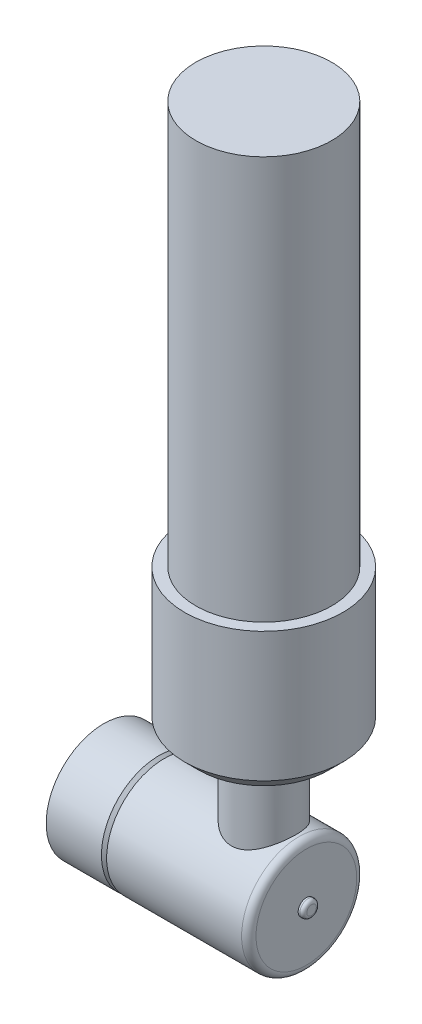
ISO-10303-21;
HEADER;
FILE_DESCRIPTION(('STEP AP214'),'2;1');
FILE_NAME('part.step','',(''),(''),'','','');
FILE_SCHEMA(('AUTOMOTIVE_DESIGN { 1 0 10303 214 1 1 1 1 }'));
ENDSEC;
DATA;
#1=APPLICATION_CONTEXT('core data for automotive mechanical design processes');
#2=APPLICATION_PROTOCOL_DEFINITION('international standard','automotive_design',2000,#1);
#3=PRODUCT_CONTEXT('',#1,'mechanical');
#4=PRODUCT('Part','Part','',(#3));
#5=PRODUCT_RELATED_PRODUCT_CATEGORY('part','',(#4));
#6=PRODUCT_DEFINITION_FORMATION('','',#4);
#7=PRODUCT_DEFINITION_CONTEXT('part definition',#1,'design');
#8=PRODUCT_DEFINITION('design','',#6,#7);
#9=PRODUCT_DEFINITION_SHAPE('','',#8);
#10=(LENGTH_UNIT() NAMED_UNIT(*) SI_UNIT(.MILLI.,.METRE.));
#11=(NAMED_UNIT(*) PLANE_ANGLE_UNIT() SI_UNIT($,.RADIAN.));
#12=(NAMED_UNIT(*) SI_UNIT($,.STERADIAN.) SOLID_ANGLE_UNIT());
#13=UNCERTAINTY_MEASURE_WITH_UNIT(LENGTH_MEASURE(1.E-05),#10,'distance_accuracy_value','');
#14=(GEOMETRIC_REPRESENTATION_CONTEXT(3) GLOBAL_UNCERTAINTY_ASSIGNED_CONTEXT((#13)) GLOBAL_UNIT_ASSIGNED_CONTEXT((#10,
#11,#12)) REPRESENTATION_CONTEXT('',''));
#15=CARTESIAN_POINT('',(0.,0.,0.));
#16=DIRECTION('',(0.,0.,1.));
#17=DIRECTION('',(1.,0.,0.));
#18=AXIS2_PLACEMENT_3D('',#15,#16,#17);
#19=CARTESIAN_POINT('',(91.694,0.,0.));
#20=DIRECTION('',(-1.,0.,0.));
#21=DIRECTION('',(0.,0.,1.));
#22=AXIS2_PLACEMENT_3D('',#19,#20,#21);
#23=CYLINDRICAL_SURFACE('',#22,3.6195);
#24=CARTESIAN_POINT('',(90.17,0.,0.));
#25=DIRECTION('',(1.,0.,0.));
#26=DIRECTION('',(0.,0.,-1.));
#27=AXIS2_PLACEMENT_3D('',#24,#25,#26);
#28=CIRCLE('',#27,3.6195);
#29=CARTESIAN_POINT('',(90.17,0.,-3.6195));
#30=VERTEX_POINT('',#29);
#31=EDGE_CURVE('E11',#30,#30,#28,.F.);
#32=ORIENTED_EDGE('',*,*,#31,.T.);
#33=EDGE_LOOP('',(#32));
#34=FACE_BOUND('',#33,.T.);
#35=CARTESIAN_POINT('',(89.408,0.,0.));
#36=DIRECTION('',(1.,0.,0.));
#37=DIRECTION('',(0.,0.,-1.));
#38=AXIS2_PLACEMENT_3D('',#35,#36,#37);
#39=CIRCLE('',#38,3.6195);
#40=CARTESIAN_POINT('',(89.408,0.,-3.6195));
#41=VERTEX_POINT('',#40);
#42=EDGE_CURVE('E400',#41,#41,#39,.T.);
#43=ORIENTED_EDGE('',*,*,#42,.T.);
#44=EDGE_LOOP('',(#43));
#45=FACE_BOUND('',#44,.T.);
#46=ADVANCED_FACE('F390',(#34,#45),#23,.T.);
#47=CARTESIAN_POINT('',(91.694,0.,0.));
#48=DIRECTION('',(1.,0.,0.));
#49=DIRECTION('',(0.,0.,-1.));
#50=AXIS2_PLACEMENT_3D('',#47,#48,#49);
#51=PLANE('',#50);
#52=CARTESIAN_POINT('',(91.694,0.,0.));
#53=DIRECTION('',(1.,0.,0.));
#54=DIRECTION('',(0.,0.,-1.));
#55=AXIS2_PLACEMENT_3D('',#52,#53,#54);
#56=CIRCLE('',#55,2.0955);
#57=CARTESIAN_POINT('',(91.694,0.,-2.0955));
#58=VERTEX_POINT('',#57);
#59=EDGE_CURVE('E396',#58,#58,#56,.T.);
#60=ORIENTED_EDGE('',*,*,#59,.T.);
#61=EDGE_LOOP('',(#60));
#62=FACE_BOUND('',#61,.T.);
#63=ADVANCED_FACE('F411',(#62),#51,.T.);
#64=CARTESIAN_POINT('',(89.408,0.,0.));
#65=DIRECTION('',(1.,0.,0.));
#66=DIRECTION('',(0.,0.,-1.));
#67=AXIS2_PLACEMENT_3D('',#64,#65,#66);
#68=PLANE('',#67);
#69=ORIENTED_EDGE('',*,*,#42,.F.);
#70=EDGE_LOOP('',(#69));
#71=FACE_BOUND('',#70,.T.);
#72=ADVANCED_FACE('F408',(#71),#68,.F.);
#73=CARTESIAN_POINT('',(90.17,0.,0.));
#74=DIRECTION('',(1.,0.,0.));
#75=DIRECTION('',(0.,0.,-1.));
#76=AXIS2_PLACEMENT_3D('',#73,#74,#75);
#77=TOROIDAL_SURFACE('',#76,2.0955,1.524);
#78=ORIENTED_EDGE('',*,*,#31,.F.);
#79=EDGE_LOOP('',(#78));
#80=FACE_BOUND('',#79,.T.);
#81=ORIENTED_EDGE('',*,*,#59,.F.);
#82=EDGE_LOOP('',(#81));
#83=FACE_BOUND('',#82,.T.);
#84=ADVANCED_FACE('F410',(#80,#83),#77,.T.);
#85=CLOSED_SHELL('',(#46,#63,#72,#84));
#86=MANIFOLD_SOLID_BREP('B2',#85);
#87=CARTESIAN_POINT('',(70.612,120.65,0.));
#88=DIRECTION('',(0.,1.,0.));
#89=DIRECTION('',(-1.,0.,0.));
#90=AXIS2_PLACEMENT_3D('',#87,#88,#89);
#91=PLANE('',#90);
#92=CARTESIAN_POINT('',(70.612,120.65,0.));
#93=DIRECTION('',(0.,1.,0.));
#94=DIRECTION('',(-1.,0.,0.));
#95=AXIS2_PLACEMENT_3D('',#92,#93,#94);
#96=CIRCLE('',#95,34.925);
#97=CARTESIAN_POINT('',(35.687,120.65,0.));
#98=VERTEX_POINT('',#97);
#99=EDGE_CURVE('E543',#98,#98,#96,.T.);
#100=ORIENTED_EDGE('',*,*,#99,.T.);
#101=EDGE_LOOP('',(#100));
#102=FACE_BOUND('',#101,.T.);
#103=CARTESIAN_POINT('',(70.612,120.65,0.));
#104=DIRECTION('',(0.,1.,0.));
#105=DIRECTION('',(-1.,0.,0.));
#106=AXIS2_PLACEMENT_3D('',#103,#104,#105);
#107=CIRCLE('',#106,29.972);
#108=CARTESIAN_POINT('',(40.6399999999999,120.65,0.));
#109=VERTEX_POINT('',#108);
#110=EDGE_CURVE('E559',#109,#109,#107,.T.);
#111=ORIENTED_EDGE('',*,*,#110,.F.);
#112=EDGE_LOOP('',(#111));
#113=FACE_BOUND('',#112,.T.);
#114=ADVANCED_FACE('F448',(#102,#113),#91,.T.);
#115=CARTESIAN_POINT('',(89.408,0.,0.));
#116=DIRECTION('',(-1.,0.,0.));
#117=DIRECTION('',(0.,0.,1.));
#118=AXIS2_PLACEMENT_3D('',#115,#116,#117);
#119=CYLINDRICAL_SURFACE('',#118,25.4);
#120=CARTESIAN_POINT('',(86.233,0.,0.));
#121=DIRECTION('',(1.,0.,0.));
#122=DIRECTION('',(0.,0.,-1.));
#123=AXIS2_PLACEMENT_3D('',#120,#121,#122);
#124=CIRCLE('',#123,25.4);
#125=CARTESIAN_POINT('',(86.233,0.,-25.4));
#126=VERTEX_POINT('',#125);
#127=EDGE_CURVE('E461',#126,#126,#124,.F.);
#128=ORIENTED_EDGE('',*,*,#127,.T.);
#129=EDGE_LOOP('',(#128));
#130=FACE_BOUND('',#129,.T.);
#131=CARTESIAN_POINT('',(26.67,0.,0.));
#132=DIRECTION('',(1.,0.,0.));
#133=DIRECTION('',(0.,0.,-1.));
#134=AXIS2_PLACEMENT_3D('',#131,#132,#133);
#135=CIRCLE('',#134,25.4);
#136=CARTESIAN_POINT('',(26.67,0.,-25.4));
#137=VERTEX_POINT('',#136);
#138=EDGE_CURVE('E476',#137,#137,#135,.T.);
#139=ORIENTED_EDGE('',*,*,#138,.T.);
#140=EDGE_LOOP('',(#139));
#141=FACE_BOUND('',#140,.T.);
#142=CARTESIAN_POINT('',(56.388,25.4,0.));
#143=CARTESIAN_POINT('',(56.387998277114,25.4000015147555,0.36870087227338));
#144=CARTESIAN_POINT('',(56.4023506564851,25.3919554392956,0.737380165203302));
#145=CARTESIAN_POINT('',(56.4595581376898,25.3599855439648,1.47180213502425));
#146=CARTESIAN_POINT('',(56.5024110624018,25.3360629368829,1.83754503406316));
#147=CARTESIAN_POINT('',(56.6160575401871,25.2729500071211,2.56334225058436));
#148=CARTESIAN_POINT('',(56.6868535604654,25.23375833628,2.92339606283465));
#149=CARTESIAN_POINT('',(56.8555056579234,25.1410819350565,3.63522175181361));
#150=CARTESIAN_POINT('',(56.9533625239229,25.0875967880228,3.98699338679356));
#151=CARTESIAN_POINT('',(57.1745985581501,24.9678386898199,4.6786503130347));
#152=CARTESIAN_POINT('',(57.2978799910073,24.9016147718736,5.01857546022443));
#153=CARTESIAN_POINT('',(57.5689372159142,24.7577487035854,5.68598521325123));
#154=CARTESIAN_POINT('',(57.7167127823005,24.6801066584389,6.01346993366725));
#155=CARTESIAN_POINT('',(58.0354451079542,24.515076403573,6.65436190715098));
#156=CARTESIAN_POINT('',(58.20640115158,24.4276884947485,6.96776959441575));
#157=CARTESIAN_POINT('',(58.570260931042,24.2449283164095,7.57927040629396));
#158=CARTESIAN_POINT('',(58.7631727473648,24.1495531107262,7.87735783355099));
#159=CARTESIAN_POINT('',(59.1839017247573,23.9458354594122,8.47727627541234));
#160=CARTESIAN_POINT('',(59.4132173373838,23.8370526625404,8.77790704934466));
#161=CARTESIAN_POINT('',(59.8941000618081,23.6149470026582,9.3590091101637));
#162=CARTESIAN_POINT('',(60.1456680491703,23.5016239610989,9.63947960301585));
#163=CARTESIAN_POINT('',(60.6700740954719,23.272816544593,10.1794940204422));
#164=CARTESIAN_POINT('',(60.9429359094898,23.1573298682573,10.439013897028));
#165=CARTESIAN_POINT('',(61.5084182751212,22.9269790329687,10.9356550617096));
#166=CARTESIAN_POINT('',(61.8010331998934,22.8121147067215,11.172782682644));
#167=CARTESIAN_POINT('',(62.4363375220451,22.5739627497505,11.6470476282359));
#168=CARTESIAN_POINT('',(62.7810728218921,22.4510370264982,11.8816353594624));
#169=CARTESIAN_POINT('',(63.4918775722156,22.2131004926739,12.3207368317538));
#170=CARTESIAN_POINT('',(63.8579498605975,22.0980907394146,12.5252465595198));
#171=CARTESIAN_POINT('',(64.6091914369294,21.8801850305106,12.9021257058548));
#172=CARTESIAN_POINT('',(64.9943375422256,21.7772748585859,13.0745329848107));
#173=CARTESIAN_POINT('',(65.7818526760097,21.5875498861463,13.3854740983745));
#174=CARTESIAN_POINT('',(66.1842163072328,21.5007300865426,13.5240184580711));
#175=CARTESIAN_POINT('',(66.9158558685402,21.3634994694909,13.7394876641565));
#176=CARTESIAN_POINT('',(67.2424157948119,21.3092726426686,13.8232525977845));
#177=CARTESIAN_POINT('',(67.9026044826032,21.2149003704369,13.9676579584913));
#178=CARTESIAN_POINT('',(68.2362322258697,21.1747529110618,14.0283016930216));
#179=CARTESIAN_POINT('',(68.9081659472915,21.1099304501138,14.1256598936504));
#180=CARTESIAN_POINT('',(69.2464676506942,21.0852421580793,14.1623949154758));
#181=CARTESIAN_POINT('',(69.9256466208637,21.0521703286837,14.2115098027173));
#182=CARTESIAN_POINT('',(70.2665239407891,21.0437871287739,14.2238891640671));
#183=CARTESIAN_POINT('',(70.9486844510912,21.0436382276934,14.2241094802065));
#184=CARTESIAN_POINT('',(71.2899676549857,21.0518917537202,14.2119220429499));
#185=CARTESIAN_POINT('',(71.9699814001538,21.0847477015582,14.1631306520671));
#186=CARTESIAN_POINT('',(72.3087119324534,21.1093501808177,14.1265266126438));
#187=CARTESIAN_POINT('',(72.9814001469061,21.1740338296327,14.0293863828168));
#188=CARTESIAN_POINT('',(73.315355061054,21.2141236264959,13.9688368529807));
#189=CARTESIAN_POINT('',(73.976175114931,21.3084141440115,13.8245757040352));
#190=CARTESIAN_POINT('',(74.3030400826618,21.3626152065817,13.7408635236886));
#191=CARTESIAN_POINT('',(74.947503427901,21.4833495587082,13.5513204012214));
#192=CARTESIAN_POINT('',(75.2651121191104,21.5498684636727,13.4455152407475));
#193=CARTESIAN_POINT('',(75.8901060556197,21.693401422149,13.212684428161));
#194=CARTESIAN_POINT('',(76.1974878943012,21.7704189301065,13.0856517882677));
#195=CARTESIAN_POINT('',(76.80077912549,21.9329523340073,12.811362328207));
#196=CARTESIAN_POINT('',(77.0966874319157,22.0184690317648,12.6641035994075));
#197=CARTESIAN_POINT('',(77.6760541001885,22.1960047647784,12.3502983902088));
#198=CARTESIAN_POINT('',(77.95951177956,22.2880241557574,12.1837508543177));
#199=CARTESIAN_POINT('',(78.5559557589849,22.4911970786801,11.8050442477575));
#200=CARTESIAN_POINT('',(78.8667372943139,22.603110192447,11.5898137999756));
#201=CARTESIAN_POINT('',(79.4694036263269,22.8301008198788,11.1360159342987));
#202=CARTESIAN_POINT('',(79.7612920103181,22.9451777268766,10.8974529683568));
#203=CARTESIAN_POINT('',(80.3253868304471,23.1758798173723,10.3978059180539));
#204=CARTESIAN_POINT('',(80.597575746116,23.291505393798,10.1367022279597));
#205=CARTESIAN_POINT('',(81.1208067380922,23.5205764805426,9.59319869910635));
#206=CARTESIAN_POINT('',(81.3718479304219,23.6340218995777,9.31079797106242));
#207=CARTESIAN_POINT('',(81.8766785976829,23.8678787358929,8.69504849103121));
#208=CARTESIAN_POINT('',(82.1279905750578,23.9877714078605,8.35946338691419));
#209=CARTESIAN_POINT('',(82.6012863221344,24.2185491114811,7.6652257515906));
#210=CARTESIAN_POINT('',(82.8232676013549,24.3294333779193,7.30657126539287));
#211=CARTESIAN_POINT('',(83.2356789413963,24.5390213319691,6.56837501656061));
#212=CARTESIAN_POINT('',(83.4261242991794,24.6377309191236,6.18884350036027));
#213=CARTESIAN_POINT('',(83.77338462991,24.820113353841,5.41122718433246));
#214=CARTESIAN_POINT('',(83.9302037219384,24.903788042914,5.01314466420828));
#215=CARTESIAN_POINT('',(84.1983037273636,25.0482264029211,4.2300741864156));
#216=CARTESIAN_POINT('',(84.3120144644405,25.1101888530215,3.84613945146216));
#217=CARTESIAN_POINT('',(84.5070270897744,25.2171160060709,3.06778748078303));
#218=CARTESIAN_POINT('',(84.5883302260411,25.2620813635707,2.67337064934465));
#219=CARTESIAN_POINT('',(84.7172692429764,25.3336449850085,1.87772541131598));
#220=CARTESIAN_POINT('',(84.7649306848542,25.3602571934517,1.4765024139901));
#221=CARTESIAN_POINT('',(84.8259231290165,25.3943454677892,0.670660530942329));
#222=CARTESIAN_POINT('',(84.8392576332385,25.4018234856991,0.266041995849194));
#223=CARTESIAN_POINT('',(84.8318518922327,25.3976777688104,-0.495906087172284));
#224=CARTESIAN_POINT('',(84.8148753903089,25.3881638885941,-0.853290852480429));
#225=CARTESIAN_POINT('',(84.7541486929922,25.35424131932,-1.56503785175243));
#226=CARTESIAN_POINT('',(84.7104009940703,25.329834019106,-1.91940036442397));
#227=CARTESIAN_POINT('',(84.5966741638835,25.2667113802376,-2.62258088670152));
#228=CARTESIAN_POINT('',(84.5266949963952,25.2279960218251,-2.97139888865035));
#229=CARTESIAN_POINT('',(84.3613202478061,25.1371609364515,-3.66116958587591));
#230=CARTESIAN_POINT('',(84.265923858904,25.0850407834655,-4.00212203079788));
#231=CARTESIAN_POINT('',(84.0513340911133,24.9688893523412,-4.67221260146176));
#232=CARTESIAN_POINT('',(83.9322751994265,24.9049255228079,-5.00140562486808));
#233=CARTESIAN_POINT('',(83.6711690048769,24.7662569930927,-5.64817781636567));
#234=CARTESIAN_POINT('',(83.529122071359,24.6915524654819,-5.96575717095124));
#235=CARTESIAN_POINT('',(83.2232055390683,24.5329008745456,-6.58785559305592));
#236=CARTESIAN_POINT('',(83.0593332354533,24.4489526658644,-6.89237303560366));
#237=CARTESIAN_POINT('',(82.7109475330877,24.2734363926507,-7.48708468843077));
#238=CARTESIAN_POINT('',(82.5264317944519,24.1818674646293,-7.77727726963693));
#239=CARTESIAN_POINT('',(82.1177948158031,23.9830367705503,-8.37149811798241));
#240=CARTESIAN_POINT('',(81.8915510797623,23.8751314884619,-8.67385283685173));
#241=CARTESIAN_POINT('',(81.4167311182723,23.6545099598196,-9.2586088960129));
#242=CARTESIAN_POINT('',(81.1681535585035,23.5417934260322,-9.54100904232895));
#243=CARTESIAN_POINT('',(80.6496805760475,23.3139138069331,-10.0850628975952));
#244=CARTESIAN_POINT('',(80.3797629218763,23.198748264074,-10.3466943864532));
#245=CARTESIAN_POINT('',(79.8200223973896,22.9686831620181,-10.8478397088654));
#246=CARTESIAN_POINT('',(79.5301992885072,22.8537836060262,-11.0873532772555));
#247=CARTESIAN_POINT('',(78.9006285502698,22.6151661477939,-11.5669025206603));
#248=CARTESIAN_POINT('',(78.5588226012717,22.4917725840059,-11.8044061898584));
#249=CARTESIAN_POINT('',(77.8537579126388,22.2524368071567,-12.2496106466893));
#250=CARTESIAN_POINT('',(77.490496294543,22.1364955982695,-12.457307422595));
#251=CARTESIAN_POINT('',(76.7446931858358,21.9162267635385,-12.8408674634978));
#252=CARTESIAN_POINT('',(76.362174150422,21.8118860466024,-13.016766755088));
#253=CARTESIAN_POINT('',(75.5796738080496,21.6187892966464,-13.3350157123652));
#254=CARTESIAN_POINT('',(75.1796978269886,21.5300285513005,-13.4773755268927));
#255=CARTESIAN_POINT('',(74.4506880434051,21.3886341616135,-13.7003609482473));
#256=CARTESIAN_POINT('',(74.1243983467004,21.3323282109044,-13.7876727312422));
#257=CARTESIAN_POINT('',(73.4644277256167,21.2336477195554,-13.9391679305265));
#258=CARTESIAN_POINT('',(73.1307478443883,21.1912712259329,-14.0033545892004));
#259=CARTESIAN_POINT('',(72.4583677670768,21.1219126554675,-14.1077547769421));
#260=CARTESIAN_POINT('',(72.1196722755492,21.0949169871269,-14.1479894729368));
#261=CARTESIAN_POINT('',(71.4393439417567,21.0572311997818,-14.2040193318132));
#262=CARTESIAN_POINT('',(71.0977110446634,21.0465413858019,-14.2198140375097));
#263=CARTESIAN_POINT('',(70.4135857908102,21.0418636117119,-14.2267352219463));
#264=CARTESIAN_POINT('',(70.0710929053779,21.0478997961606,-14.2178260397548));
#265=CARTESIAN_POINT('',(69.3883384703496,21.0764992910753,-14.1753950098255));
#266=CARTESIAN_POINT('',(69.048076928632,21.0990626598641,-14.1418730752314));
#267=CARTESIAN_POINT('',(68.3720616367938,21.1599086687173,-14.0506674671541));
#268=CARTESIAN_POINT('',(68.0363104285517,21.198199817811,-13.9929707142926));
#269=CARTESIAN_POINT('',(67.3716887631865,21.2891766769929,-13.8541626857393));
#270=CARTESIAN_POINT('',(67.0428184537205,21.3418626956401,-13.7730509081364));
#271=CARTESIAN_POINT('',(66.3961305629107,21.4595194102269,-13.5889974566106));
#272=CARTESIAN_POINT('',(66.0782510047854,21.5244000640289,-13.4862151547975));
#273=CARTESIAN_POINT('',(65.4524886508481,21.6648415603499,-13.2594276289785));
#274=CARTESIAN_POINT('',(65.1446091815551,21.740405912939,-13.135415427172));
#275=CARTESIAN_POINT('',(64.5401214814,21.900240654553,-12.8671607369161));
#276=CARTESIAN_POINT('',(64.2435142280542,21.9845117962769,-12.7229164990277));
#277=CARTESIAN_POINT('',(63.6625615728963,22.1597788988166,-12.4151343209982));
#278=CARTESIAN_POINT('',(63.3782168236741,22.2507752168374,-12.2515953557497));
#279=CARTESIAN_POINT('',(62.7803505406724,22.451763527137,-11.8797932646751));
#280=CARTESIAN_POINT('',(62.4689666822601,22.5625400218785,-11.6685107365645));
#281=CARTESIAN_POINT('',(61.8647716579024,22.7875673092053,-11.2227051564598));
#282=CARTESIAN_POINT('',(61.5719570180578,22.9018174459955,-10.9881864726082));
#283=CARTESIAN_POINT('',(61.0056663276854,23.1311995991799,-10.496723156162));
#284=CARTESIAN_POINT('',(60.7322074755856,23.2463323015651,-10.239759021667));
#285=CARTESIAN_POINT('',(60.20606332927,23.4747775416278,-9.70461098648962));
#286=CARTESIAN_POINT('',(59.9533789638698,23.5880899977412,-9.42642613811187));
#287=CARTESIAN_POINT('',(59.4434814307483,23.822613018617,-8.81819999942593));
#288=CARTESIAN_POINT('',(59.1888192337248,23.9433240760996,-8.48581901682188));
#289=CARTESIAN_POINT('',(58.7085334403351,24.1761498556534,-7.79779939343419));
#290=CARTESIAN_POINT('',(58.4829123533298,24.2882638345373,-7.44215874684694));
#291=CARTESIAN_POINT('',(58.0629017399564,24.500711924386,-6.70972609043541));
#292=CARTESIAN_POINT('',(57.8684985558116,24.6010511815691,-6.33294342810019));
#293=CARTESIAN_POINT('',(57.5130054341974,24.7870637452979,-5.56050451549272));
#294=CARTESIAN_POINT('',(57.35191167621,24.8727387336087,-5.16485043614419));
#295=CARTESIAN_POINT('',(57.0744460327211,25.0217986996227,-4.38375358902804));
#296=CARTESIAN_POINT('',(56.9558550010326,25.0862671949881,-3.99930638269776));
#297=CARTESIAN_POINT('',(56.7512591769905,25.198226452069,-3.21939839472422));
#298=CARTESIAN_POINT('',(56.665253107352,25.2457178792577,-2.8239380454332));
#299=CARTESIAN_POINT('',(56.5271576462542,25.3222689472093,-2.02567105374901));
#300=CARTESIAN_POINT('',(56.4750431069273,25.3513422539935,-1.62287008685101));
#301=CARTESIAN_POINT('',(56.4054667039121,25.390206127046,-0.813370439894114));
#302=CARTESIAN_POINT('',(56.3880019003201,25.3999983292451,-0.406672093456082));
#303=CARTESIAN_POINT('',(56.388,25.4,0.));
#304=B_SPLINE_CURVE_WITH_KNOTS('',3,(#142,#143,#144,#145,#146,#147,#148,#149,#150,#151,#152,
#153,#154,#155,#156,#157,#158,#159,#160,#161,#162,#163,#164,#165,#166,#167,#168,#169,#170,#171,
#172,#173,#174,#175,#176,#177,#178,#179,#180,#181,#182,#183,#184,#185,#186,#187,#188,#189,#190,
#191,#192,#193,#194,#195,#196,#197,#198,#199,#200,#201,#202,#203,#204,#205,#206,#207,#208,#209,
#210,#211,#212,#213,#214,#215,#216,#217,#218,#219,#220,#221,#222,#223,#224,#225,#226,#227,#228,
#229,#230,#231,#232,#233,#234,#235,#236,#237,#238,#239,#240,#241,#242,#243,#244,#245,#246,#247,
#248,#249,#250,#251,#252,#253,#254,#255,#256,#257,#258,#259,#260,#261,#262,#263,#264,#265,#266,
#267,#268,#269,#270,#271,#272,#273,#274,#275,#276,#277,#278,#279,#280,#281,#282,#283,#284,#285,
#286,#287,#288,#289,#290,#291,#292,#293,#294,#295,#296,#297,#298,#299,#300,#301,#302,#303),
.UNSPECIFIED.,.T.,.F.,(4,2,2,2,2,2,2,2,2,2,2,2,2,2,2,2,2,2,2,2,2,2,2,2,2,2,2,2,2,2,2,2,2,2,2,2,
2,2,2,2,2,2,2,2,2,2,2,2,2,2,2,2,2,2,2,2,2,2,2,2,2,2,2,2,2,2,2,2,2,2,2,2,2,2,2,2,2,2,2,2,4),(0.,
1.10570123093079,2.21131800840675,3.31703242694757,4.42277908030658,5.52435178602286,
6.62591434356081,7.72744290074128,8.82937817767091,10.0084971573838,11.1876625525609,
12.3681627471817,13.5483280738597,14.850891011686,16.1536275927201,17.4548179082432,
18.7556032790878,19.7789401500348,20.8021305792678,21.8244401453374,22.8467708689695,
23.8702837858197,24.893800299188,25.9178877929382,26.9420001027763,27.9649239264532,
28.9881851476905,30.0115429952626,31.0349568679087,32.2165010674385,33.3978202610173,
34.5801775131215,35.7625841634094,37.0691041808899,38.3757350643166,39.681730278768,
40.9875654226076,42.2014053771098,43.4151985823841,44.628068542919,45.8408147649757,
46.9132541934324,47.9855936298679,49.0579345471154,50.1303095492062,51.1967555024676,
52.2631843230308,53.3297454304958,54.3964275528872,55.5734403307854,56.7505234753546,
57.9288494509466,59.1071895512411,60.4079748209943,61.7089350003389,63.0084118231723,
64.3074949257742,65.3337301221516,66.3598213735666,67.3850044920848,68.4102067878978,
69.436889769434,70.4635763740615,71.4908191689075,72.5180839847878,73.5380422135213,
74.5583363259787,75.5787187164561,76.5991553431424,77.7747525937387,78.9501292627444,
80.1265375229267,81.3029983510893,82.6086775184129,83.9144694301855,85.2196884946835,
86.5247577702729,87.7453893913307,88.9659731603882,90.185650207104,91.4052237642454),.UNSPECIFIED.);
#305=CARTESIAN_POINT('',(56.388,25.4,0.));
#306=VERTEX_POINT('',#305);
#307=EDGE_CURVE('E470',#306,#306,#304,.T.);
#308=ORIENTED_EDGE('',*,*,#307,.F.);
#309=EDGE_LOOP('',(#308));
#310=FACE_BOUND('',#309,.T.);
#311=ADVANCED_FACE('F450',(#130,#141,#310),#119,.T.);
#312=CARTESIAN_POINT('',(89.408,0.,0.));
#313=DIRECTION('',(1.,0.,0.));
#314=DIRECTION('',(0.,0.,-1.));
#315=AXIS2_PLACEMENT_3D('',#312,#313,#314);
#316=PLANE('',#315);
#317=CARTESIAN_POINT('',(89.408,0.,0.));
#318=DIRECTION('',(1.,0.,0.));
#319=DIRECTION('',(0.,0.,-1.));
#320=AXIS2_PLACEMENT_3D('',#317,#318,#319);
#321=CIRCLE('',#320,22.225);
#322=CARTESIAN_POINT('',(89.408,0.,-22.225));
#323=VERTEX_POINT('',#322);
#324=EDGE_CURVE('E465',#323,#323,#321,.T.);
#325=ORIENTED_EDGE('',*,*,#324,.T.);
#326=EDGE_LOOP('',(#325));
#327=FACE_BOUND('',#326,.T.);
#328=ADVANCED_FACE('F488',(#327),#316,.T.);
#329=CARTESIAN_POINT('',(26.67,0.,0.));
#330=DIRECTION('',(1.,0.,0.));
#331=DIRECTION('',(0.,0.,-1.));
#332=AXIS2_PLACEMENT_3D('',#329,#330,#331);
#333=PLANE('',#332);
#334=ORIENTED_EDGE('',*,*,#138,.F.);
#335=EDGE_LOOP('',(#334));
#336=FACE_BOUND('',#335,.T.);
#337=ADVANCED_FACE('F484',(#336),#333,.F.);
#338=CARTESIAN_POINT('',(70.612,194.691,0.));
#339=DIRECTION('',(0.,1.,0.));
#340=DIRECTION('',(-1.,0.,0.));
#341=AXIS2_PLACEMENT_3D('',#338,#339,#340);
#342=CYLINDRICAL_SURFACE('',#341,14.224);
#343=CARTESIAN_POINT('',(70.612,50.8,0.));
#344=DIRECTION('',(0.,1.,0.));
#345=DIRECTION('',(-1.,0.,0.));
#346=AXIS2_PLACEMENT_3D('',#343,#344,#345);
#347=CIRCLE('',#346,14.224);
#348=CARTESIAN_POINT('',(56.388,50.8,0.));
#349=VERTEX_POINT('',#348);
#350=EDGE_CURVE('E540',#349,#349,#347,.T.);
#351=ORIENTED_EDGE('',*,*,#350,.F.);
#352=EDGE_LOOP('',(#351));
#353=FACE_BOUND('',#352,.T.);
#354=ORIENTED_EDGE('',*,*,#307,.T.);
#355=EDGE_LOOP('',(#354));
#356=FACE_BOUND('',#355,.T.);
#357=ADVANCED_FACE('F478',(#353,#356),#342,.T.);
#358=CARTESIAN_POINT('',(86.233,0.,0.));
#359=DIRECTION('',(1.,0.,0.));
#360=DIRECTION('',(0.,0.,-1.));
#361=AXIS2_PLACEMENT_3D('',#358,#359,#360);
#362=TOROIDAL_SURFACE('',#361,22.225,3.175);
#363=ORIENTED_EDGE('',*,*,#127,.F.);
#364=EDGE_LOOP('',(#363));
#365=FACE_BOUND('',#364,.T.);
#366=ORIENTED_EDGE('',*,*,#324,.F.);
#367=EDGE_LOOP('',(#366));
#368=FACE_BOUND('',#367,.T.);
#369=ADVANCED_FACE('F483',(#365,#368),#362,.T.);
#370=CARTESIAN_POINT('',(70.612,50.8,0.));
#371=DIRECTION('',(0.,1.,0.));
#372=DIRECTION('',(-1.,0.,0.));
#373=AXIS2_PLACEMENT_3D('',#370,#371,#372);
#374=CONICAL_SURFACE('',#373,14.224,0.78539816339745);
#375=CARTESIAN_POINT('',(70.612,57.15,0.));
#376=DIRECTION('',(0.,1.,0.));
#377=DIRECTION('',(-1.,0.,0.));
#378=AXIS2_PLACEMENT_3D('',#375,#376,#377);
#379=CIRCLE('',#378,20.574);
#380=CARTESIAN_POINT('',(50.038,57.15,0.));
#381=VERTEX_POINT('',#380);
#382=EDGE_CURVE('E538',#381,#381,#379,.T.);
#383=ORIENTED_EDGE('',*,*,#382,.F.);
#384=EDGE_LOOP('',(#383));
#385=FACE_BOUND('',#384,.T.);
#386=ORIENTED_EDGE('',*,*,#350,.T.);
#387=EDGE_LOOP('',(#386));
#388=FACE_BOUND('',#387,.T.);
#389=ADVANCED_FACE('F520',(#385,#388),#374,.T.);
#390=CARTESIAN_POINT('',(70.612,57.15,0.));
#391=DIRECTION('',(0.,1.,0.));
#392=DIRECTION('',(-1.,0.,0.));
#393=AXIS2_PLACEMENT_3D('',#390,#391,#392);
#394=PLANE('',#393);
#395=CARTESIAN_POINT('',(70.612,57.15,0.));
#396=DIRECTION('',(0.,1.,0.));
#397=DIRECTION('',(-1.,0.,0.));
#398=AXIS2_PLACEMENT_3D('',#395,#396,#397);
#399=CIRCLE('',#398,28.575);
#400=CARTESIAN_POINT('',(42.037,57.15,0.));
#401=VERTEX_POINT('',#400);
#402=EDGE_CURVE('E389',#401,#401,#399,.F.);
#403=ORIENTED_EDGE('',*,*,#402,.T.);
#404=EDGE_LOOP('',(#403));
#405=FACE_BOUND('',#404,.T.);
#406=ORIENTED_EDGE('',*,*,#382,.T.);
#407=EDGE_LOOP('',(#406));
#408=FACE_BOUND('',#407,.T.);
#409=ADVANCED_FACE('F508',(#405,#408),#394,.F.);
#410=CARTESIAN_POINT('',(70.612,120.65,0.));
#411=DIRECTION('',(0.,-1.,0.));
#412=DIRECTION('',(1.,0.,0.));
#413=AXIS2_PLACEMENT_3D('',#410,#411,#412);
#414=CYLINDRICAL_SURFACE('',#413,34.925);
#415=CARTESIAN_POINT('',(70.612,63.5,0.));
#416=DIRECTION('',(0.,1.,0.));
#417=DIRECTION('',(0.,0.,1.));
#418=AXIS2_PLACEMENT_3D('',#415,#416,#417);
#419=CIRCLE('',#418,34.925);
#420=CARTESIAN_POINT('',(70.612,63.5,34.925));
#421=VERTEX_POINT('',#420);
#422=EDGE_CURVE('E457',#421,#421,#419,.T.);
#423=ORIENTED_EDGE('',*,*,#422,.T.);
#424=EDGE_LOOP('',(#423));
#425=FACE_BOUND('',#424,.T.);
#426=ORIENTED_EDGE('',*,*,#99,.F.);
#427=EDGE_LOOP('',(#426));
#428=FACE_BOUND('',#427,.T.);
#429=ADVANCED_FACE('F510',(#425,#428),#414,.T.);
#430=CARTESIAN_POINT('',(70.612,63.5,0.));
#431=DIRECTION('',(0.,1.,0.));
#432=DIRECTION('',(0.,0.,1.));
#433=AXIS2_PLACEMENT_3D('',#430,#431,#432);
#434=CONICAL_SURFACE('',#433,34.925,0.78539816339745);
#435=ORIENTED_EDGE('',*,*,#402,.F.);
#436=EDGE_LOOP('',(#435));
#437=FACE_BOUND('',#436,.T.);
#438=ORIENTED_EDGE('',*,*,#422,.F.);
#439=EDGE_LOOP('',(#438));
#440=FACE_BOUND('',#439,.T.);
#441=ADVANCED_FACE('F513',(#437,#440),#434,.T.);
#442=CARTESIAN_POINT('',(70.6119999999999,298.45,0.));
#443=DIRECTION('',(0.,-1.,0.));
#444=DIRECTION('',(1.,0.,0.));
#445=AXIS2_PLACEMENT_3D('',#442,#443,#444);
#446=CYLINDRICAL_SURFACE('',#445,29.972);
#447=CARTESIAN_POINT('',(70.6119999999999,298.45,0.));
#448=DIRECTION('',(0.,1.,0.));
#449=DIRECTION('',(-1.,0.,0.));
#450=AXIS2_PLACEMENT_3D('',#447,#448,#449);
#451=CIRCLE('',#450,29.972);
#452=CARTESIAN_POINT('',(40.6399999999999,298.45,0.));
#453=VERTEX_POINT('',#452);
#454=EDGE_CURVE('E556',#453,#453,#451,.T.);
#455=ORIENTED_EDGE('',*,*,#454,.F.);
#456=EDGE_LOOP('',(#455));
#457=FACE_BOUND('',#456,.T.);
#458=ORIENTED_EDGE('',*,*,#110,.T.);
#459=EDGE_LOOP('',(#458));
#460=FACE_BOUND('',#459,.T.);
#461=ADVANCED_FACE('F563',(#457,#460),#446,.T.);
#462=CARTESIAN_POINT('',(70.6119999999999,298.45,0.));
#463=DIRECTION('',(0.,1.,0.));
#464=DIRECTION('',(-1.,0.,0.));
#465=AXIS2_PLACEMENT_3D('',#462,#463,#464);
#466=PLANE('',#465);
#467=ORIENTED_EDGE('',*,*,#454,.T.);
#468=EDGE_LOOP('',(#467));
#469=FACE_BOUND('',#468,.T.);
#470=ADVANCED_FACE('F564',(#469),#466,.T.);
#471=CLOSED_SHELL('',(#114,#311,#328,#337,#357,#369,#389,#409,#429,#441,#461,#470));
#472=CARTESIAN_POINT('',(70.612,28.448,0.));
#473=DIRECTION('',(0.,1.,0.));
#474=DIRECTION('',(-1.,0.,0.));
#475=AXIS2_PLACEMENT_3D('',#472,#473,#474);
#476=PLANE('',#475);
#477=CARTESIAN_POINT('',(70.612,28.448,0.));
#478=DIRECTION('',(0.,1.,0.));
#479=DIRECTION('',(-1.,0.,0.));
#480=AXIS2_PLACEMENT_3D('',#477,#478,#479);
#481=CIRCLE('',#480,11.938);
#482=CARTESIAN_POINT('',(58.674,28.448,0.));
#483=VERTEX_POINT('',#482);
#484=EDGE_CURVE('E534',#483,#483,#481,.T.);
#485=ORIENTED_EDGE('',*,*,#484,.T.);
#486=EDGE_LOOP('',(#485));
#487=FACE_BOUND('',#486,.T.);
#488=ADVANCED_FACE('F524',(#487),#476,.T.);
#489=CARTESIAN_POINT('',(70.612,28.448,0.));
#490=DIRECTION('',(0.,1.,0.));
#491=DIRECTION('',(-1.,0.,0.));
#492=AXIS2_PLACEMENT_3D('',#489,#490,#491);
#493=CYLINDRICAL_SURFACE('',#492,11.938);
#494=ORIENTED_EDGE('',*,*,#484,.F.);
#495=EDGE_LOOP('',(#494));
#496=FACE_BOUND('',#495,.T.);
#497=CARTESIAN_POINT('',(70.612,50.8,0.));
#498=DIRECTION('',(0.,1.,0.));
#499=DIRECTION('',(-1.,0.,0.));
#500=AXIS2_PLACEMENT_3D('',#497,#498,#499);
#501=CIRCLE('',#500,11.938);
#502=CARTESIAN_POINT('',(58.674,50.8,0.));
#503=VERTEX_POINT('',#502);
#504=EDGE_CURVE('E537',#503,#503,#501,.F.);
#505=ORIENTED_EDGE('',*,*,#504,.F.);
#506=EDGE_LOOP('',(#505));
#507=FACE_BOUND('',#506,.T.);
#508=ADVANCED_FACE('F517',(#496,#507),#493,.F.);
#509=CARTESIAN_POINT('',(70.612,50.8,0.));
#510=DIRECTION('',(0.,1.,0.));
#511=DIRECTION('',(-1.,0.,0.));
#512=AXIS2_PLACEMENT_3D('',#509,#510,#511);
#513=PLANE('',#512);
#514=ORIENTED_EDGE('',*,*,#504,.T.);
#515=EDGE_LOOP('',(#514));
#516=FACE_BOUND('',#515,.T.);
#517=ADVANCED_FACE('F514',(#516),#513,.F.);
#518=CLOSED_SHELL('',(#488,#508,#517));
#519=ORIENTED_CLOSED_SHELL('',*,#518,.T.);
#520=BREP_WITH_VOIDS('B6',#471,(#519));
#521=CARTESIAN_POINT('',(25.908,0.,0.));
#522=DIRECTION('',(1.,0.,0.));
#523=DIRECTION('',(0.,0.,-1.));
#524=AXIS2_PLACEMENT_3D('',#521,#522,#523);
#525=PLANE('',#524);
#526=CARTESIAN_POINT('',(25.908,0.,0.));
#527=DIRECTION('',(1.,0.,0.));
#528=DIRECTION('',(0.,0.,-1.));
#529=AXIS2_PLACEMENT_3D('',#526,#527,#528);
#530=CIRCLE('',#529,23.876);
#531=CARTESIAN_POINT('',(25.908,0.,-23.876));
#532=VERTEX_POINT('',#531);
#533=EDGE_CURVE('E648',#532,#532,#530,.T.);
#534=ORIENTED_EDGE('',*,*,#533,.T.);
#535=EDGE_LOOP('',(#534));
#536=FACE_BOUND('',#535,.T.);
#537=CARTESIAN_POINT('',(25.908,0.,0.));
#538=DIRECTION('',(1.,0.,0.));
#539=DIRECTION('',(0.,0.,-1.));
#540=AXIS2_PLACEMENT_3D('',#537,#538,#539);
#541=CIRCLE('',#540,22.225);
#542=CARTESIAN_POINT('',(25.908,0.,22.225));
#543=VERTEX_POINT('',#542);
#544=EDGE_CURVE('E661',#543,#543,#541,.T.);
#545=ORIENTED_EDGE('',*,*,#544,.F.);
#546=EDGE_LOOP('',(#545));
#547=FACE_BOUND('',#546,.T.);
#548=ADVANCED_FACE('F641',(#536,#547),#525,.T.);
#549=CARTESIAN_POINT('',(25.908,0.,0.));
#550=DIRECTION('',(-1.,0.,0.));
#551=DIRECTION('',(0.,0.,1.));
#552=AXIS2_PLACEMENT_3D('',#549,#550,#551);
#553=CYLINDRICAL_SURFACE('',#552,25.4);
#554=CARTESIAN_POINT('',(24.384,0.,0.));
#555=DIRECTION('',(1.,0.,0.));
#556=DIRECTION('',(0.,0.,-1.));
#557=AXIS2_PLACEMENT_3D('',#554,#555,#556);
#558=CIRCLE('',#557,25.4);
#559=CARTESIAN_POINT('',(24.384,0.,-25.4));
#560=VERTEX_POINT('',#559);
#561=EDGE_CURVE('E446',#560,#560,#558,.F.);
#562=ORIENTED_EDGE('',*,*,#561,.T.);
#563=EDGE_LOOP('',(#562));
#564=FACE_BOUND('',#563,.T.);
#565=CARTESIAN_POINT('',(0.,0.,0.));
#566=DIRECTION('',(1.,0.,0.));
#567=DIRECTION('',(0.,0.,-1.));
#568=AXIS2_PLACEMENT_3D('',#565,#566,#567);
#569=CIRCLE('',#568,25.4);
#570=CARTESIAN_POINT('',(0.,0.,-25.4));
#571=VERTEX_POINT('',#570);
#572=EDGE_CURVE('E652',#571,#571,#569,.T.);
#573=ORIENTED_EDGE('',*,*,#572,.T.);
#574=EDGE_LOOP('',(#573));
#575=FACE_BOUND('',#574,.T.);
#576=ADVANCED_FACE('F643',(#564,#575),#553,.T.);
#577=CARTESIAN_POINT('',(0.,0.,0.));
#578=DIRECTION('',(1.,0.,0.));
#579=DIRECTION('',(0.,0.,-1.));
#580=AXIS2_PLACEMENT_3D('',#577,#578,#579);
#581=PLANE('',#580);
#582=CARTESIAN_POINT('',(0.,0.,0.));
#583=DIRECTION('',(1.,0.,0.));
#584=DIRECTION('',(0.,0.,-1.));
#585=AXIS2_PLACEMENT_3D('',#582,#583,#584);
#586=CIRCLE('',#585,23.876);
#587=CARTESIAN_POINT('',(0.,0.,-23.876));
#588=VERTEX_POINT('',#587);
#589=EDGE_CURVE('E665',#588,#588,#586,.T.);
#590=ORIENTED_EDGE('',*,*,#589,.T.);
#591=EDGE_LOOP('',(#590));
#592=FACE_BOUND('',#591,.T.);
#593=ORIENTED_EDGE('',*,*,#572,.F.);
#594=EDGE_LOOP('',(#593));
#595=FACE_BOUND('',#594,.T.);
#596=ADVANCED_FACE('F704',(#592,#595),#581,.F.);
#597=CARTESIAN_POINT('',(26.67,0.,0.));
#598=DIRECTION('',(-1.,0.,0.));
#599=DIRECTION('',(0.,0.,1.));
#600=AXIS2_PLACEMENT_3D('',#597,#598,#599);
#601=CYLINDRICAL_SURFACE('',#600,22.225);
#602=CARTESIAN_POINT('',(26.67,0.,0.));
#603=DIRECTION('',(1.,0.,0.));
#604=DIRECTION('',(0.,0.,-1.));
#605=AXIS2_PLACEMENT_3D('',#602,#603,#604);
#606=CIRCLE('',#605,22.225);
#607=CARTESIAN_POINT('',(26.67,0.,22.225));
#608=VERTEX_POINT('',#607);
#609=EDGE_CURVE('E656',#608,#608,#606,.T.);
#610=CARTESIAN_POINT('',(26.67,0.,22.225));
#611=CARTESIAN_POINT('',(26.6620625,0.,22.225));
#612=CARTESIAN_POINT('',(26.654125,0.,22.225));
#613=CARTESIAN_POINT('',(26.63825,0.,22.225));
#614=CARTESIAN_POINT('',(26.6303125,0.,22.225));
#615=CARTESIAN_POINT('',(26.6144375,0.,22.225));
#616=CARTESIAN_POINT('',(26.6065,0.,22.225));
#617=CARTESIAN_POINT('',(26.590625,0.,22.225));
#618=CARTESIAN_POINT('',(26.5826875,0.,22.225));
#619=CARTESIAN_POINT('',(26.5668125,0.,22.225));
#620=CARTESIAN_POINT('',(26.558875,0.,22.225));
#621=CARTESIAN_POINT('',(26.543,0.,22.225));
#622=CARTESIAN_POINT('',(26.5350625,0.,22.225));
#623=CARTESIAN_POINT('',(26.5191875,0.,22.225));
#624=CARTESIAN_POINT('',(26.51125,0.,22.225));
#625=CARTESIAN_POINT('',(26.495375,0.,22.225));
#626=CARTESIAN_POINT('',(26.4874375,0.,22.225));
#627=CARTESIAN_POINT('',(26.4715625,0.,22.225));
#628=CARTESIAN_POINT('',(26.463625,0.,22.225));
#629=CARTESIAN_POINT('',(26.44775,0.,22.225));
#630=CARTESIAN_POINT('',(26.4398125,0.,22.225));
#631=CARTESIAN_POINT('',(26.4239375,0.,22.225));
#632=CARTESIAN_POINT('',(26.416,0.,22.225));
#633=CARTESIAN_POINT('',(26.400125,0.,22.225));
#634=CARTESIAN_POINT('',(26.3921875,0.,22.225));
#635=CARTESIAN_POINT('',(26.3763125,0.,22.225));
#636=CARTESIAN_POINT('',(26.368375,0.,22.225));
#637=CARTESIAN_POINT('',(26.3525,0.,22.225));
#638=CARTESIAN_POINT('',(26.3445625,0.,22.225));
#639=CARTESIAN_POINT('',(26.3286875,0.,22.225));
#640=CARTESIAN_POINT('',(26.32075,0.,22.225));
#641=CARTESIAN_POINT('',(26.304875,0.,22.225));
#642=CARTESIAN_POINT('',(26.2969375,0.,22.225));
#643=CARTESIAN_POINT('',(26.2810625,0.,22.225));
#644=CARTESIAN_POINT('',(26.273125,0.,22.225));
#645=CARTESIAN_POINT('',(26.25725,0.,22.225));
#646=CARTESIAN_POINT('',(26.2493125,0.,22.225));
#647=CARTESIAN_POINT('',(26.2334375,0.,22.225));
#648=CARTESIAN_POINT('',(26.2255,0.,22.225));
#649=CARTESIAN_POINT('',(26.209625,0.,22.225));
#650=CARTESIAN_POINT('',(26.2016875,0.,22.225));
#651=CARTESIAN_POINT('',(26.1858125,0.,22.225));
#652=CARTESIAN_POINT('',(26.177875,0.,22.225));
#653=CARTESIAN_POINT('',(26.162,0.,22.225));
#654=CARTESIAN_POINT('',(26.1540625,0.,22.225));
#655=CARTESIAN_POINT('',(26.1381875,0.,22.225));
#656=CARTESIAN_POINT('',(26.13025,0.,22.225));
#657=CARTESIAN_POINT('',(26.114375,0.,22.225));
#658=CARTESIAN_POINT('',(26.1064375,0.,22.225));
#659=CARTESIAN_POINT('',(26.0905625,0.,22.225));
#660=CARTESIAN_POINT('',(26.082625,0.,22.225));
#661=CARTESIAN_POINT('',(26.06675,0.,22.225));
#662=CARTESIAN_POINT('',(26.0588125,0.,22.225));
#663=CARTESIAN_POINT('',(26.0429375,0.,22.225));
#664=CARTESIAN_POINT('',(26.035,0.,22.225));
#665=CARTESIAN_POINT('',(26.019125,0.,22.225));
#666=CARTESIAN_POINT('',(26.0111875,0.,22.225));
#667=CARTESIAN_POINT('',(25.9953125,0.,22.225));
#668=CARTESIAN_POINT('',(25.987375,0.,22.225));
#669=CARTESIAN_POINT('',(25.9715,0.,22.225));
#670=CARTESIAN_POINT('',(25.9635625,0.,22.225));
#671=CARTESIAN_POINT('',(25.9476875,0.,22.225));
#672=CARTESIAN_POINT('',(25.93975,0.,22.225));
#673=CARTESIAN_POINT('',(25.923875,0.,22.225));
#674=CARTESIAN_POINT('',(25.9159375,0.,22.225));
#675=CARTESIAN_POINT('',(25.908,0.,22.225));
#676=B_SPLINE_CURVE_WITH_KNOTS('',3,(#610,#611,#612,#613,#614,#615,#616,#617,#618,#619,#620,
#621,#622,#623,#624,#625,#626,#627,#628,#629,#630,#631,#632,#633,#634,#635,#636,#637,#638,#639,
#640,#641,#642,#643,#644,#645,#646,#647,#648,#649,#650,#651,#652,#653,#654,#655,#656,#657,#658,
#659,#660,#661,#662,#663,#664,#665,#666,#667,#668,#669,#670,#671,#672,#673,#674,#675),
.UNSPECIFIED.,.F.,.F.,(4,2,2,2,2,2,2,2,2,2,2,2,2,2,2,2,2,2,2,2,2,2,2,2,2,2,2,2,2,2,2,2,4),(0.,
0.0238125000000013,0.0476250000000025,0.0714375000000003,0.0952500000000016,0.119062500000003,
0.142875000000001,0.166687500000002,0.190500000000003,0.214312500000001,0.238125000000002,
0.2619375,0.285750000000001,0.309562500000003,0.333375,0.357187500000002,0.381000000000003,
0.404812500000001,0.428625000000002,0.4524375,0.476250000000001,0.500062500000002,0.523875,
0.547687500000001,0.571500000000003,0.5953125,0.619125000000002,0.642937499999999,
0.666750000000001,0.690562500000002,0.714375,0.738187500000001,0.762000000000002),.UNSPECIFIED.);
#677=EDGE_CURVE('BSEAM709',#608,#543,#676,.T.);
#678=ORIENTED_EDGE('',*,*,#609,.F.);
#679=ORIENTED_EDGE('',*,*,#544,.T.);
#680=ORIENTED_EDGE('',*,*,#677,.T.);
#681=ORIENTED_EDGE('',*,*,#677,.F.);
#682=EDGE_LOOP('',(#678,#680,#679,#681));
#683=FACE_BOUND('',#682,.T.);
#684=ADVANCED_FACE('F709',(#683),#601,.T.);
#685=CARTESIAN_POINT('',(26.67,0.,0.));
#686=DIRECTION('',(1.,0.,0.));
#687=DIRECTION('',(0.,0.,-1.));
#688=AXIS2_PLACEMENT_3D('',#685,#686,#687);
#689=PLANE('',#688);
#690=ORIENTED_EDGE('',*,*,#609,.T.);
#691=EDGE_LOOP('',(#690));
#692=FACE_BOUND('',#691,.T.);
#693=ADVANCED_FACE('F683',(#692),#689,.T.);
#694=CARTESIAN_POINT('',(24.384,0.,0.));
#695=DIRECTION('',(1.,0.,0.));
#696=DIRECTION('',(0.,0.,-1.));
#697=AXIS2_PLACEMENT_3D('',#694,#695,#696);
#698=PLANE('',#697);
#699=CARTESIAN_POINT('',(24.384,0.,0.));
#700=DIRECTION('',(1.,0.,0.));
#701=DIRECTION('',(0.,0.,-1.));
#702=AXIS2_PLACEMENT_3D('',#699,#700,#701);
#703=CIRCLE('',#702,23.876);
#704=CARTESIAN_POINT('',(24.384,0.,-23.876));
#705=VERTEX_POINT('',#704);
#706=EDGE_CURVE('E664',#705,#705,#703,.T.);
#707=ORIENTED_EDGE('',*,*,#706,.F.);
#708=EDGE_LOOP('',(#707));
#709=FACE_BOUND('',#708,.T.);
#710=CARTESIAN_POINT('',(24.384,0.,0.));
#711=DIRECTION('',(1.,0.,0.));
#712=DIRECTION('',(0.,0.,-1.));
#713=AXIS2_PLACEMENT_3D('',#710,#711,#712);
#714=CIRCLE('',#713,20.701);
#715=CARTESIAN_POINT('',(24.384,0.,20.701));
#716=VERTEX_POINT('',#715);
#717=EDGE_CURVE('E671',#716,#716,#714,.T.);
#718=ORIENTED_EDGE('',*,*,#717,.T.);
#719=EDGE_LOOP('',(#718));
#720=FACE_BOUND('',#719,.T.);
#721=ADVANCED_FACE('F680',(#709,#720),#698,.F.);
#722=CARTESIAN_POINT('',(25.908,0.,0.));
#723=DIRECTION('',(-1.,0.,0.));
#724=DIRECTION('',(0.,0.,1.));
#725=AXIS2_PLACEMENT_3D('',#722,#723,#724);
#726=CYLINDRICAL_SURFACE('',#725,23.876);
#727=ORIENTED_EDGE('',*,*,#706,.T.);
#728=EDGE_LOOP('',(#727));
#729=FACE_BOUND('',#728,.T.);
#730=ORIENTED_EDGE('',*,*,#589,.F.);
#731=EDGE_LOOP('',(#730));
#732=FACE_BOUND('',#731,.T.);
#733=ADVANCED_FACE('F677',(#729,#732),#726,.F.);
#734=CARTESIAN_POINT('',(26.67,0.,0.));
#735=DIRECTION('',(-1.,0.,0.));
#736=DIRECTION('',(0.,0.,1.));
#737=AXIS2_PLACEMENT_3D('',#734,#735,#736);
#738=CYLINDRICAL_SURFACE('',#737,20.701);
#739=CARTESIAN_POINT('',(25.146,0.,0.));
#740=DIRECTION('',(1.,0.,0.));
#741=DIRECTION('',(0.,0.,-1.));
#742=AXIS2_PLACEMENT_3D('',#739,#740,#741);
#743=CIRCLE('',#742,20.701);
#744=CARTESIAN_POINT('',(25.146,0.,20.701));
#745=VERTEX_POINT('',#744);
#746=EDGE_CURVE('E668',#745,#745,#743,.T.);
#747=CARTESIAN_POINT('',(25.146,0.,20.701));
#748=CARTESIAN_POINT('',(25.1380625,0.,20.701));
#749=CARTESIAN_POINT('',(25.130125,0.,20.701));
#750=CARTESIAN_POINT('',(25.11425,0.,20.701));
#751=CARTESIAN_POINT('',(25.1063125,0.,20.701));
#752=CARTESIAN_POINT('',(25.0904375,0.,20.701));
#753=CARTESIAN_POINT('',(25.0825,0.,20.701));
#754=CARTESIAN_POINT('',(25.066625,0.,20.701));
#755=CARTESIAN_POINT('',(25.0586875,0.,20.701));
#756=CARTESIAN_POINT('',(25.0428125,0.,20.701));
#757=CARTESIAN_POINT('',(25.034875,0.,20.701));
#758=CARTESIAN_POINT('',(25.019,0.,20.701));
#759=CARTESIAN_POINT('',(25.0110625,0.,20.701));
#760=CARTESIAN_POINT('',(24.9951875,0.,20.701));
#761=CARTESIAN_POINT('',(24.98725,0.,20.701));
#762=CARTESIAN_POINT('',(24.971375,0.,20.701));
#763=CARTESIAN_POINT('',(24.9634375,0.,20.701));
#764=CARTESIAN_POINT('',(24.9475625,0.,20.701));
#765=CARTESIAN_POINT('',(24.939625,0.,20.701));
#766=CARTESIAN_POINT('',(24.92375,0.,20.701));
#767=CARTESIAN_POINT('',(24.9158125,0.,20.701));
#768=CARTESIAN_POINT('',(24.8999375,0.,20.701));
#769=CARTESIAN_POINT('',(24.892,0.,20.701));
#770=CARTESIAN_POINT('',(24.876125,0.,20.701));
#771=CARTESIAN_POINT('',(24.8681875,0.,20.701));
#772=CARTESIAN_POINT('',(24.8523125,0.,20.701));
#773=CARTESIAN_POINT('',(24.844375,0.,20.701));
#774=CARTESIAN_POINT('',(24.8285,0.,20.701));
#775=CARTESIAN_POINT('',(24.8205625,0.,20.701));
#776=CARTESIAN_POINT('',(24.8046875,0.,20.701));
#777=CARTESIAN_POINT('',(24.79675,0.,20.701));
#778=CARTESIAN_POINT('',(24.780875,0.,20.701));
#779=CARTESIAN_POINT('',(24.7729375,0.,20.701));
#780=CARTESIAN_POINT('',(24.7570625,0.,20.701));
#781=CARTESIAN_POINT('',(24.749125,0.,20.701));
#782=CARTESIAN_POINT('',(24.73325,0.,20.701));
#783=CARTESIAN_POINT('',(24.7253125,0.,20.701));
#784=CARTESIAN_POINT('',(24.7094375,0.,20.701));
#785=CARTESIAN_POINT('',(24.7015,0.,20.701));
#786=CARTESIAN_POINT('',(24.685625,0.,20.701));
#787=CARTESIAN_POINT('',(24.6776875,0.,20.701));
#788=CARTESIAN_POINT('',(24.6618125,0.,20.701));
#789=CARTESIAN_POINT('',(24.653875,0.,20.701));
#790=CARTESIAN_POINT('',(24.638,0.,20.701));
#791=CARTESIAN_POINT('',(24.6300625,0.,20.701));
#792=CARTESIAN_POINT('',(24.6141875,0.,20.701));
#793=CARTESIAN_POINT('',(24.60625,0.,20.701));
#794=CARTESIAN_POINT('',(24.590375,0.,20.701));
#795=CARTESIAN_POINT('',(24.5824375,0.,20.701));
#796=CARTESIAN_POINT('',(24.5665625,0.,20.701));
#797=CARTESIAN_POINT('',(24.558625,0.,20.701));
#798=CARTESIAN_POINT('',(24.54275,0.,20.701));
#799=CARTESIAN_POINT('',(24.5348125,0.,20.701));
#800=CARTESIAN_POINT('',(24.5189375,0.,20.701));
#801=CARTESIAN_POINT('',(24.511,0.,20.701));
#802=CARTESIAN_POINT('',(24.495125,0.,20.701));
#803=CARTESIAN_POINT('',(24.4871875,0.,20.701));
#804=CARTESIAN_POINT('',(24.4713125,0.,20.701));
#805=CARTESIAN_POINT('',(24.463375,0.,20.701));
#806=CARTESIAN_POINT('',(24.4475,0.,20.701));
#807=CARTESIAN_POINT('',(24.4395625,0.,20.701));
#808=CARTESIAN_POINT('',(24.4236875,0.,20.701));
#809=CARTESIAN_POINT('',(24.41575,0.,20.701));
#810=CARTESIAN_POINT('',(24.399875,0.,20.701));
#811=CARTESIAN_POINT('',(24.3919375,0.,20.701));
#812=CARTESIAN_POINT('',(24.384,0.,20.701));
#813=B_SPLINE_CURVE_WITH_KNOTS('',3,(#747,#748,#749,#750,#751,#752,#753,#754,#755,#756,#757,
#758,#759,#760,#761,#762,#763,#764,#765,#766,#767,#768,#769,#770,#771,#772,#773,#774,#775,#776,
#777,#778,#779,#780,#781,#782,#783,#784,#785,#786,#787,#788,#789,#790,#791,#792,#793,#794,#795,
#796,#797,#798,#799,#800,#801,#802,#803,#804,#805,#806,#807,#808,#809,#810,#811,#812),
.UNSPECIFIED.,.F.,.F.,(4,2,2,2,2,2,2,2,2,2,2,2,2,2,2,2,2,2,2,2,2,2,2,2,2,2,2,2,2,2,2,2,4),(0.,
0.0238125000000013,0.0476250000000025,0.0714375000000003,0.0952500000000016,0.119062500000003,
0.142875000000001,0.166687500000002,0.1905,0.214312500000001,0.238125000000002,0.2619375,
0.285750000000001,0.309562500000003,0.333375,0.357187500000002,0.380999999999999,
0.404812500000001,0.428625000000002,0.4524375,0.476250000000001,0.500062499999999,0.523875,
0.547687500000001,0.571499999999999,0.5953125,0.619125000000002,0.642937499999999,
0.666750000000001,0.690562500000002,0.714375,0.738187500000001,0.761999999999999),.UNSPECIFIED.);
#814=EDGE_CURVE('BSEAM687',#745,#716,#813,.T.);
#815=ORIENTED_EDGE('',*,*,#746,.T.);
#816=ORIENTED_EDGE('',*,*,#717,.F.);
#817=ORIENTED_EDGE('',*,*,#814,.T.);
#818=ORIENTED_EDGE('',*,*,#814,.F.);
#819=EDGE_LOOP('',(#815,#817,#816,#818));
#820=FACE_BOUND('',#819,.T.);
#821=ADVANCED_FACE('F687',(#820),#738,.F.);
#822=CARTESIAN_POINT('',(25.146,0.,0.));
#823=DIRECTION('',(1.,0.,0.));
#824=DIRECTION('',(0.,0.,-1.));
#825=AXIS2_PLACEMENT_3D('',#822,#823,#824);
#826=PLANE('',#825);
#827=ORIENTED_EDGE('',*,*,#746,.F.);
#828=EDGE_LOOP('',(#827));
#829=FACE_BOUND('',#828,.T.);
#830=ADVANCED_FACE('F689',(#829),#826,.F.);
#831=CARTESIAN_POINT('',(25.908,0.,0.));
#832=DIRECTION('',(-1.,0.,0.));
#833=DIRECTION('',(0.,0.,1.));
#834=AXIS2_PLACEMENT_3D('',#831,#832,#833);
#835=CONICAL_SURFACE('',#834,23.876,0.785398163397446);
#836=ORIENTED_EDGE('',*,*,#561,.F.);
#837=EDGE_LOOP('',(#836));
#838=FACE_BOUND('',#837,.T.);
#839=ORIENTED_EDGE('',*,*,#533,.F.);
#840=EDGE_LOOP('',(#839));
#841=FACE_BOUND('',#840,.T.);
#842=ADVANCED_FACE('F696',(#838,#841),#835,.T.);
#843=CLOSED_SHELL('',(#548,#576,#596,#684,#693,#721,#733,#821,#830,#842));
#844=MANIFOLD_SOLID_BREP('B384',#843);
#845=ADVANCED_BREP_SHAPE_REPRESENTATION('',(#18,#86,#520,#844),#14);
#846=SHAPE_DEFINITION_REPRESENTATION(#9,#845);
ENDSEC;
END-ISO-10303-21;
